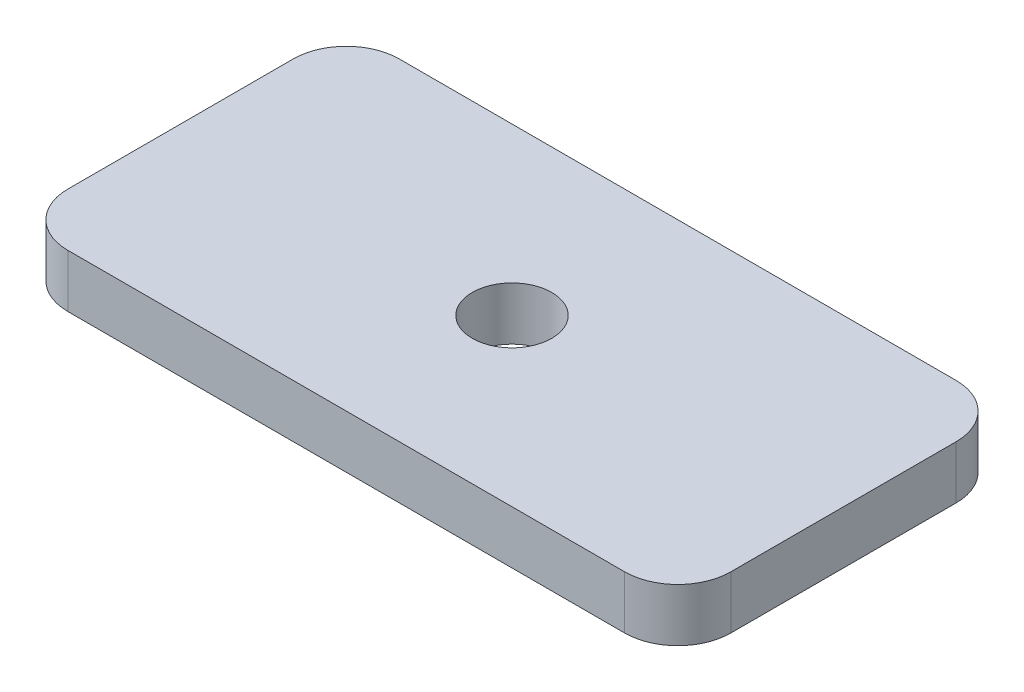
ISO-10303-21;
HEADER;
FILE_DESCRIPTION(('STEP AP214'),'2;1');
FILE_NAME('part.step','',(''),(''),'','','');
FILE_SCHEMA(('AUTOMOTIVE_DESIGN { 1 0 10303 214 1 1 1 1 }'));
ENDSEC;
DATA;
#1=APPLICATION_CONTEXT('core data for automotive mechanical design processes');
#2=APPLICATION_PROTOCOL_DEFINITION('international standard','automotive_design',2000,#1);
#3=PRODUCT_CONTEXT('',#1,'mechanical');
#4=PRODUCT('Part','Part','',(#3));
#5=PRODUCT_RELATED_PRODUCT_CATEGORY('part','',(#4));
#6=PRODUCT_DEFINITION_FORMATION('','',#4);
#7=PRODUCT_DEFINITION_CONTEXT('part definition',#1,'design');
#8=PRODUCT_DEFINITION('design','',#6,#7);
#9=PRODUCT_DEFINITION_SHAPE('','',#8);
#10=(LENGTH_UNIT() NAMED_UNIT(*) SI_UNIT(.MILLI.,.METRE.));
#11=(NAMED_UNIT(*) PLANE_ANGLE_UNIT() SI_UNIT($,.RADIAN.));
#12=(NAMED_UNIT(*) SI_UNIT($,.STERADIAN.) SOLID_ANGLE_UNIT());
#13=UNCERTAINTY_MEASURE_WITH_UNIT(LENGTH_MEASURE(1.E-05),#10,'distance_accuracy_value','');
#14=(GEOMETRIC_REPRESENTATION_CONTEXT(3) GLOBAL_UNCERTAINTY_ASSIGNED_CONTEXT((#13)) GLOBAL_UNIT_ASSIGNED_CONTEXT((#10,
#11,#12)) REPRESENTATION_CONTEXT('',''));
#15=CARTESIAN_POINT('',(0.,0.,0.));
#16=DIRECTION('',(0.,0.,1.));
#17=DIRECTION('',(1.,0.,0.));
#18=AXIS2_PLACEMENT_3D('',#15,#16,#17);
#19=CARTESIAN_POINT('',(42.,8.,-17.));
#20=DIRECTION('',(0.,-1.,0.));
#21=DIRECTION('',(0.,0.,-1.));
#22=AXIS2_PLACEMENT_3D('',#19,#20,#21);
#23=CYLINDRICAL_SURFACE('',#22,8.);
#24=CARTESIAN_POINT('',(42.,0.,-17.));
#25=DIRECTION('',(0.,1.,0.));
#26=DIRECTION('',(0.,0.,-1.));
#27=AXIS2_PLACEMENT_3D('',#24,#25,#26);
#28=CIRCLE('',#27,8.);
#29=CARTESIAN_POINT('',(50.,0.,-17.));
#30=VERTEX_POINT('',#29);
#31=CARTESIAN_POINT('',(42.,0.,-25.));
#32=VERTEX_POINT('',#31);
#33=EDGE_CURVE('E128',#30,#32,#28,.T.);
#34=ORIENTED_EDGE('',*,*,#33,.T.);
#35=DIRECTION('',(0.,-1.,0.));
#36=VECTOR('',#35,1.);
#37=CARTESIAN_POINT('',(42.,8.,-25.));
#38=LINE('',#37,#36);
#39=CARTESIAN_POINT('',(42.,8.,-25.));
#40=VERTEX_POINT('',#39);
#41=EDGE_CURVE('E11',#40,#32,#38,.T.);
#42=ORIENTED_EDGE('',*,*,#41,.F.);
#43=CARTESIAN_POINT('',(42.,8.,-17.));
#44=DIRECTION('',(0.,1.,0.));
#45=DIRECTION('',(0.,0.,-1.));
#46=AXIS2_PLACEMENT_3D('',#43,#44,#45);
#47=CIRCLE('',#46,8.);
#48=CARTESIAN_POINT('',(50.,8.,-17.));
#49=VERTEX_POINT('',#48);
#50=EDGE_CURVE('E143',#49,#40,#47,.T.);
#51=ORIENTED_EDGE('',*,*,#50,.F.);
#52=DIRECTION('',(0.,-1.,0.));
#53=VECTOR('',#52,1.);
#54=CARTESIAN_POINT('',(50.,8.,-17.));
#55=LINE('',#54,#53);
#56=EDGE_CURVE('E124',#49,#30,#55,.T.);
#57=ORIENTED_EDGE('',*,*,#56,.T.);
#58=EDGE_LOOP('',(#34,#42,#51,#57));
#59=FACE_BOUND('',#58,.T.);
#60=ADVANCED_FACE('F32',(#59),#23,.T.);
#61=CARTESIAN_POINT('',(-42.,8.,-25.));
#62=DIRECTION('',(0.,0.,1.));
#63=DIRECTION('',(1.,0.,0.));
#64=AXIS2_PLACEMENT_3D('',#61,#62,#63);
#65=PLANE('',#64);
#66=DIRECTION('',(-1.,0.,0.));
#67=VECTOR('',#66,1.);
#68=CARTESIAN_POINT('',(-42.,0.,-25.));
#69=LINE('',#68,#67);
#70=CARTESIAN_POINT('',(-42.,0.,-25.));
#71=VERTEX_POINT('',#70);
#72=EDGE_CURVE('E131',#32,#71,#69,.T.);
#73=ORIENTED_EDGE('',*,*,#72,.T.);
#74=DIRECTION('',(0.,-1.,0.));
#75=VECTOR('',#74,1.);
#76=CARTESIAN_POINT('',(-42.,8.,-25.));
#77=LINE('',#76,#75);
#78=CARTESIAN_POINT('',(-42.,8.,-25.));
#79=VERTEX_POINT('',#78);
#80=EDGE_CURVE('E40',#79,#71,#77,.T.);
#81=ORIENTED_EDGE('',*,*,#80,.F.);
#82=DIRECTION('',(-1.,0.,0.));
#83=VECTOR('',#82,1.);
#84=CARTESIAN_POINT('',(-42.,8.,-25.));
#85=LINE('',#84,#83);
#86=EDGE_CURVE('E91',#40,#79,#85,.T.);
#87=ORIENTED_EDGE('',*,*,#86,.F.);
#88=ORIENTED_EDGE('',*,*,#41,.T.);
#89=EDGE_LOOP('',(#73,#81,#87,#88));
#90=FACE_BOUND('',#89,.T.);
#91=ADVANCED_FACE('F199',(#90),#65,.F.);
#92=CARTESIAN_POINT('',(-42.,8.,-17.));
#93=DIRECTION('',(0.,-1.,0.));
#94=DIRECTION('',(0.,0.,-1.));
#95=AXIS2_PLACEMENT_3D('',#92,#93,#94);
#96=CYLINDRICAL_SURFACE('',#95,8.);
#97=CARTESIAN_POINT('',(-42.,0.,-17.));
#98=DIRECTION('',(0.,1.,0.));
#99=DIRECTION('',(0.,0.,1.));
#100=AXIS2_PLACEMENT_3D('',#97,#98,#99);
#101=CIRCLE('',#100,8.);
#102=CARTESIAN_POINT('',(-50.,0.,-17.));
#103=VERTEX_POINT('',#102);
#104=EDGE_CURVE('E134',#71,#103,#101,.T.);
#105=ORIENTED_EDGE('',*,*,#104,.T.);
#106=DIRECTION('',(0.,-1.,0.));
#107=VECTOR('',#106,1.);
#108=CARTESIAN_POINT('',(-50.,8.,-17.));
#109=LINE('',#108,#107);
#110=CARTESIAN_POINT('',(-50.,8.,-17.));
#111=VERTEX_POINT('',#110);
#112=EDGE_CURVE('E150',#111,#103,#109,.T.);
#113=ORIENTED_EDGE('',*,*,#112,.F.);
#114=CARTESIAN_POINT('',(-42.,8.,-17.));
#115=DIRECTION('',(0.,1.,0.));
#116=DIRECTION('',(0.,0.,1.));
#117=AXIS2_PLACEMENT_3D('',#114,#115,#116);
#118=CIRCLE('',#117,8.);
#119=EDGE_CURVE('E158',#79,#111,#118,.T.);
#120=ORIENTED_EDGE('',*,*,#119,.F.);
#121=ORIENTED_EDGE('',*,*,#80,.T.);
#122=EDGE_LOOP('',(#105,#113,#120,#121));
#123=FACE_BOUND('',#122,.T.);
#124=ADVANCED_FACE('F156',(#123),#96,.T.);
#125=CARTESIAN_POINT('',(-50.,8.,-17.));
#126=DIRECTION('',(1.,0.,0.));
#127=DIRECTION('',(0.,0.,-1.));
#128=AXIS2_PLACEMENT_3D('',#125,#126,#127);
#129=PLANE('',#128);
#130=DIRECTION('',(0.,0.,1.));
#131=VECTOR('',#130,1.);
#132=CARTESIAN_POINT('',(-50.,0.,-17.));
#133=LINE('',#132,#131);
#134=CARTESIAN_POINT('',(-50.,0.,17.));
#135=VERTEX_POINT('',#134);
#136=EDGE_CURVE('E136',#103,#135,#133,.T.);
#137=ORIENTED_EDGE('',*,*,#136,.T.);
#138=DIRECTION('',(0.,-1.,0.));
#139=VECTOR('',#138,1.);
#140=CARTESIAN_POINT('',(-50.,8.,17.));
#141=LINE('',#140,#139);
#142=CARTESIAN_POINT('',(-50.,8.,17.));
#143=VERTEX_POINT('',#142);
#144=EDGE_CURVE('E147',#143,#135,#141,.T.);
#145=ORIENTED_EDGE('',*,*,#144,.F.);
#146=DIRECTION('',(0.,0.,1.));
#147=VECTOR('',#146,1.);
#148=CARTESIAN_POINT('',(-50.,8.,-17.));
#149=LINE('',#148,#147);
#150=EDGE_CURVE('E170',#111,#143,#149,.T.);
#151=ORIENTED_EDGE('',*,*,#150,.F.);
#152=ORIENTED_EDGE('',*,*,#112,.T.);
#153=EDGE_LOOP('',(#137,#145,#151,#152));
#154=FACE_BOUND('',#153,.T.);
#155=ADVANCED_FACE('F166',(#154),#129,.F.);
#156=CARTESIAN_POINT('',(-42.,8.,17.));
#157=DIRECTION('',(0.,-1.,0.));
#158=DIRECTION('',(0.,0.,-1.));
#159=AXIS2_PLACEMENT_3D('',#156,#157,#158);
#160=CYLINDRICAL_SURFACE('',#159,8.00000000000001);
#161=CARTESIAN_POINT('',(-42.,0.,17.));
#162=DIRECTION('',(0.,1.,0.));
#163=DIRECTION('',(0.,0.,1.));
#164=AXIS2_PLACEMENT_3D('',#161,#162,#163);
#165=CIRCLE('',#164,8.00000000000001);
#166=CARTESIAN_POINT('',(-42.,0.,25.));
#167=VERTEX_POINT('',#166);
#168=EDGE_CURVE('E138',#135,#167,#165,.T.);
#169=ORIENTED_EDGE('',*,*,#168,.T.);
#170=DIRECTION('',(0.,-1.,0.));
#171=VECTOR('',#170,1.);
#172=CARTESIAN_POINT('',(-42.,8.,25.));
#173=LINE('',#172,#171);
#174=CARTESIAN_POINT('',(-42.,8.,25.));
#175=VERTEX_POINT('',#174);
#176=EDGE_CURVE('E119',#175,#167,#173,.T.);
#177=ORIENTED_EDGE('',*,*,#176,.F.);
#178=CARTESIAN_POINT('',(-42.,8.,17.));
#179=DIRECTION('',(0.,1.,0.));
#180=DIRECTION('',(0.,0.,1.));
#181=AXIS2_PLACEMENT_3D('',#178,#179,#180);
#182=CIRCLE('',#181,8.00000000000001);
#183=EDGE_CURVE('E110',#143,#175,#182,.T.);
#184=ORIENTED_EDGE('',*,*,#183,.F.);
#185=ORIENTED_EDGE('',*,*,#144,.T.);
#186=EDGE_LOOP('',(#169,#177,#184,#185));
#187=FACE_BOUND('',#186,.T.);
#188=ADVANCED_FACE('F169',(#187),#160,.T.);
#189=CARTESIAN_POINT('',(-42.,8.,25.));
#190=DIRECTION('',(0.,0.,-1.));
#191=DIRECTION('',(-1.,0.,0.));
#192=AXIS2_PLACEMENT_3D('',#189,#190,#191);
#193=PLANE('',#192);
#194=DIRECTION('',(1.,0.,0.));
#195=VECTOR('',#194,1.);
#196=CARTESIAN_POINT('',(-42.,0.,25.));
#197=LINE('',#196,#195);
#198=CARTESIAN_POINT('',(42.,0.,25.));
#199=VERTEX_POINT('',#198);
#200=EDGE_CURVE('E118',#167,#199,#197,.T.);
#201=ORIENTED_EDGE('',*,*,#200,.T.);
#202=DIRECTION('',(0.,-1.,0.));
#203=VECTOR('',#202,1.);
#204=CARTESIAN_POINT('',(42.,8.,25.));
#205=LINE('',#204,#203);
#206=CARTESIAN_POINT('',(42.,8.,25.));
#207=VERTEX_POINT('',#206);
#208=EDGE_CURVE('E115',#207,#199,#205,.T.);
#209=ORIENTED_EDGE('',*,*,#208,.F.);
#210=DIRECTION('',(1.,0.,0.));
#211=VECTOR('',#210,1.);
#212=CARTESIAN_POINT('',(-42.,8.,25.));
#213=LINE('',#212,#211);
#214=EDGE_CURVE('E104',#175,#207,#213,.T.);
#215=ORIENTED_EDGE('',*,*,#214,.F.);
#216=ORIENTED_EDGE('',*,*,#176,.T.);
#217=EDGE_LOOP('',(#201,#209,#215,#216));
#218=FACE_BOUND('',#217,.T.);
#219=ADVANCED_FACE('F116',(#218),#193,.F.);
#220=CARTESIAN_POINT('',(42.,8.,17.));
#221=DIRECTION('',(0.,-1.,0.));
#222=DIRECTION('',(0.,0.,-1.));
#223=AXIS2_PLACEMENT_3D('',#220,#221,#222);
#224=CYLINDRICAL_SURFACE('',#223,8.00000000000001);
#225=CARTESIAN_POINT('',(42.,0.,17.));
#226=DIRECTION('',(0.,1.,0.));
#227=DIRECTION('',(0.,0.,1.));
#228=AXIS2_PLACEMENT_3D('',#225,#226,#227);
#229=CIRCLE('',#228,8.00000000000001);
#230=CARTESIAN_POINT('',(50.,0.,17.));
#231=VERTEX_POINT('',#230);
#232=EDGE_CURVE('E77',#199,#231,#229,.T.);
#233=ORIENTED_EDGE('',*,*,#232,.T.);
#234=DIRECTION('',(0.,-1.,0.));
#235=VECTOR('',#234,1.);
#236=CARTESIAN_POINT('',(50.,8.,17.));
#237=LINE('',#236,#235);
#238=CARTESIAN_POINT('',(50.,8.,17.));
#239=VERTEX_POINT('',#238);
#240=EDGE_CURVE('E120',#239,#231,#237,.T.);
#241=ORIENTED_EDGE('',*,*,#240,.F.);
#242=CARTESIAN_POINT('',(42.,8.,17.));
#243=DIRECTION('',(0.,1.,0.));
#244=DIRECTION('',(0.,0.,1.));
#245=AXIS2_PLACEMENT_3D('',#242,#243,#244);
#246=CIRCLE('',#245,8.00000000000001);
#247=EDGE_CURVE('E108',#207,#239,#246,.T.);
#248=ORIENTED_EDGE('',*,*,#247,.F.);
#249=ORIENTED_EDGE('',*,*,#208,.T.);
#250=EDGE_LOOP('',(#233,#241,#248,#249));
#251=FACE_BOUND('',#250,.T.);
#252=ADVANCED_FACE('F122',(#251),#224,.T.);
#253=CARTESIAN_POINT('',(50.,8.,-17.));
#254=DIRECTION('',(-1.,0.,0.));
#255=DIRECTION('',(0.,0.,1.));
#256=AXIS2_PLACEMENT_3D('',#253,#254,#255);
#257=PLANE('',#256);
#258=DIRECTION('',(0.,0.,-1.));
#259=VECTOR('',#258,1.);
#260=CARTESIAN_POINT('',(50.,0.,-17.));
#261=LINE('',#260,#259);
#262=EDGE_CURVE('E83',#231,#30,#261,.T.);
#263=ORIENTED_EDGE('',*,*,#262,.T.);
#264=ORIENTED_EDGE('',*,*,#56,.F.);
#265=DIRECTION('',(0.,0.,-1.));
#266=VECTOR('',#265,1.);
#267=CARTESIAN_POINT('',(50.,8.,-17.));
#268=LINE('',#267,#266);
#269=EDGE_CURVE('E48',#239,#49,#268,.T.);
#270=ORIENTED_EDGE('',*,*,#269,.F.);
#271=ORIENTED_EDGE('',*,*,#240,.T.);
#272=EDGE_LOOP('',(#263,#264,#270,#271));
#273=FACE_BOUND('',#272,.T.);
#274=ADVANCED_FACE('F190',(#273),#257,.F.);
#275=CARTESIAN_POINT('',(42.,8.,-17.));
#276=DIRECTION('',(0.,-1.,0.));
#277=DIRECTION('',(0.,0.,-1.));
#278=AXIS2_PLACEMENT_3D('',#275,#276,#277);
#279=PLANE('',#278);
#280=CARTESIAN_POINT('',(0.,8.,0.));
#281=DIRECTION('',(0.,1.,0.));
#282=DIRECTION('',(0.,0.,1.));
#283=AXIS2_PLACEMENT_3D('',#280,#281,#282);
#284=CIRCLE('',#283,6.);
#285=CARTESIAN_POINT('',(0.,8.,6.));
#286=VERTEX_POINT('',#285);
#287=EDGE_CURVE('E176',#286,#286,#284,.T.);
#288=ORIENTED_EDGE('',*,*,#287,.F.);
#289=EDGE_LOOP('',(#288));
#290=FACE_BOUND('',#289,.T.);
#291=ORIENTED_EDGE('',*,*,#50,.T.);
#292=ORIENTED_EDGE('',*,*,#86,.T.);
#293=ORIENTED_EDGE('',*,*,#119,.T.);
#294=ORIENTED_EDGE('',*,*,#150,.T.);
#295=ORIENTED_EDGE('',*,*,#183,.T.);
#296=ORIENTED_EDGE('',*,*,#214,.T.);
#297=ORIENTED_EDGE('',*,*,#247,.T.);
#298=ORIENTED_EDGE('',*,*,#269,.T.);
#299=EDGE_LOOP('',(#291,#292,#293,#294,#295,#296,#297,#298));
#300=FACE_BOUND('',#299,.T.);
#301=ADVANCED_FACE('F106',(#290,#300),#279,.F.);
#302=CARTESIAN_POINT('',(42.,0.,-17.));
#303=DIRECTION('',(0.,-1.,0.));
#304=DIRECTION('',(0.,0.,-1.));
#305=AXIS2_PLACEMENT_3D('',#302,#303,#304);
#306=PLANE('',#305);
#307=CARTESIAN_POINT('',(0.,0.,0.));
#308=DIRECTION('',(0.,1.,0.));
#309=DIRECTION('',(0.,0.,1.));
#310=AXIS2_PLACEMENT_3D('',#307,#308,#309);
#311=CIRCLE('',#310,6.);
#312=CARTESIAN_POINT('',(0.,0.,6.));
#313=VERTEX_POINT('',#312);
#314=EDGE_CURVE('E132',#313,#313,#311,.T.);
#315=ORIENTED_EDGE('',*,*,#314,.T.);
#316=EDGE_LOOP('',(#315));
#317=FACE_BOUND('',#316,.T.);
#318=ORIENTED_EDGE('',*,*,#33,.F.);
#319=ORIENTED_EDGE('',*,*,#262,.F.);
#320=ORIENTED_EDGE('',*,*,#232,.F.);
#321=ORIENTED_EDGE('',*,*,#200,.F.);
#322=ORIENTED_EDGE('',*,*,#168,.F.);
#323=ORIENTED_EDGE('',*,*,#136,.F.);
#324=ORIENTED_EDGE('',*,*,#104,.F.);
#325=ORIENTED_EDGE('',*,*,#72,.F.);
#326=EDGE_LOOP('',(#318,#319,#320,#321,#322,#323,#324,#325));
#327=FACE_BOUND('',#326,.T.);
#328=ADVANCED_FACE('F162',(#317,#327),#306,.T.);
#329=CARTESIAN_POINT('',(0.,0.,0.));
#330=DIRECTION('',(0.,1.,0.));
#331=DIRECTION('',(0.,0.,1.));
#332=AXIS2_PLACEMENT_3D('',#329,#330,#331);
#333=CYLINDRICAL_SURFACE('',#332,6.);
#334=ORIENTED_EDGE('',*,*,#314,.F.);
#335=EDGE_LOOP('',(#334));
#336=FACE_BOUND('',#335,.T.);
#337=ORIENTED_EDGE('',*,*,#287,.T.);
#338=EDGE_LOOP('',(#337));
#339=FACE_BOUND('',#338,.T.);
#340=ADVANCED_FACE('F183',(#336,#339),#333,.F.);
#341=CLOSED_SHELL('',(#60,#91,#124,#155,#188,#219,#252,#274,#301,#328,#340));
#342=MANIFOLD_SOLID_BREP('B2',#341);
#343=ADVANCED_BREP_SHAPE_REPRESENTATION('',(#18,#342),#14);
#344=SHAPE_DEFINITION_REPRESENTATION(#9,#343);
ENDSEC;
END-ISO-10303-21;
